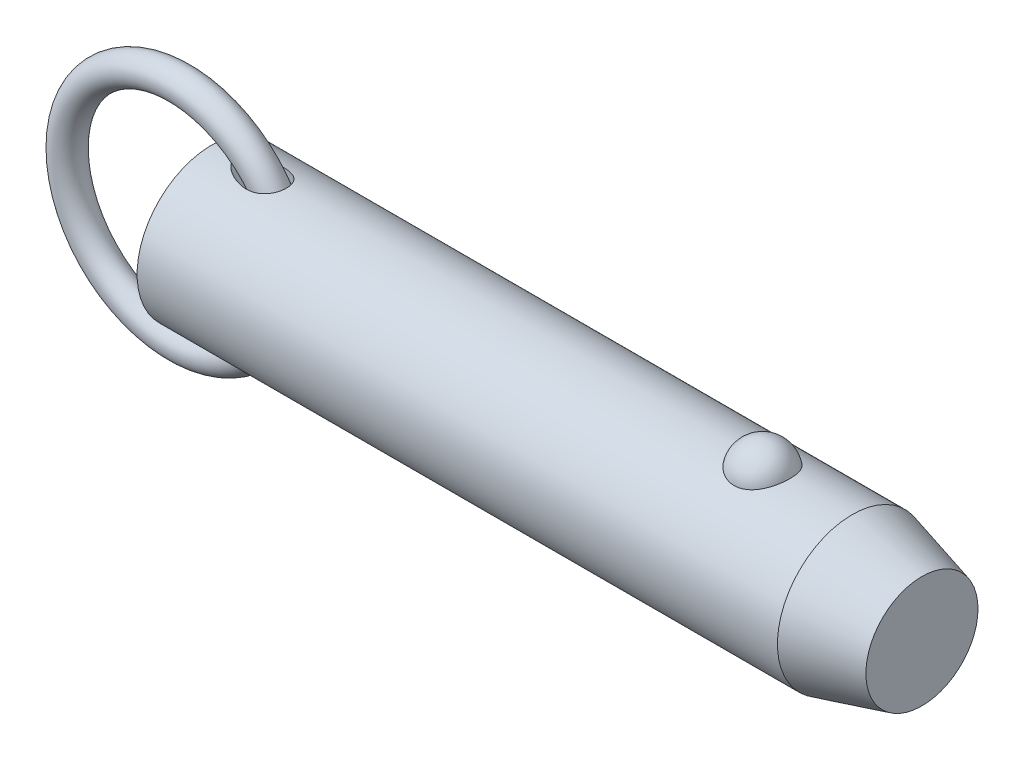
ISO-10303-21;
HEADER;
FILE_DESCRIPTION(('STEP AP214'),'2;1');
FILE_NAME('part.step','',(''),(''),'','','');
FILE_SCHEMA(('AUTOMOTIVE_DESIGN { 1 0 10303 214 1 1 1 1 }'));
ENDSEC;
DATA;
#1=APPLICATION_CONTEXT('core data for automotive mechanical design processes');
#2=APPLICATION_PROTOCOL_DEFINITION('international standard','automotive_design',2000,#1);
#3=PRODUCT_CONTEXT('',#1,'mechanical');
#4=PRODUCT('Part','Part','',(#3));
#5=PRODUCT_RELATED_PRODUCT_CATEGORY('part','',(#4));
#6=PRODUCT_DEFINITION_FORMATION('','',#4);
#7=PRODUCT_DEFINITION_CONTEXT('part definition',#1,'design');
#8=PRODUCT_DEFINITION('design','',#6,#7);
#9=PRODUCT_DEFINITION_SHAPE('','',#8);
#10=(LENGTH_UNIT() NAMED_UNIT(*) SI_UNIT(.MILLI.,.METRE.));
#11=(NAMED_UNIT(*) PLANE_ANGLE_UNIT() SI_UNIT($,.RADIAN.));
#12=(NAMED_UNIT(*) SI_UNIT($,.STERADIAN.) SOLID_ANGLE_UNIT());
#13=UNCERTAINTY_MEASURE_WITH_UNIT(LENGTH_MEASURE(1.E-05),#10,'distance_accuracy_value','');
#14=(GEOMETRIC_REPRESENTATION_CONTEXT(3) GLOBAL_UNCERTAINTY_ASSIGNED_CONTEXT((#13)) GLOBAL_UNIT_ASSIGNED_CONTEXT((#10,
#11,#12)) REPRESENTATION_CONTEXT('',''));
#15=CARTESIAN_POINT('',(0.,0.,0.));
#16=DIRECTION('',(0.,0.,1.));
#17=DIRECTION('',(1.,0.,0.));
#18=AXIS2_PLACEMENT_3D('',#15,#16,#17);
#19=CARTESIAN_POINT('',(-5.53898640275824,0.,0.));
#20=DIRECTION('',(0.,0.,1.));
#21=DIRECTION('',(1.,0.,0.));
#22=AXIS2_PLACEMENT_3D('',#19,#20,#21);
#23=TOROIDAL_SURFACE('',#22,19.05,2.54);
#24=CARTESIAN_POINT('',(16.0510135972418,0.,0.));
#25=VERTEX_POINT('',#24);
#26=VERTEX_LOOP('',#25);
#27=FACE_BOUND('',#26,.T.);
#28=ADVANCED_FACE('P0_F12',(#27),#23,.T.);
#29=CLOSED_SHELL('',(#28));
#30=MANIFOLD_SOLID_BREP('P0_B1',#29);
#31=CARTESIAN_POINT('',(0.,0.,0.));
#32=DIRECTION('',(1.,0.,0.));
#33=DIRECTION('',(0.,0.,-1.));
#34=AXIS2_PLACEMENT_3D('',#31,#32,#33);
#35=CYLINDRICAL_SURFACE('',#34,12.7);
#36=CARTESIAN_POINT('',(108.800738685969,0.,0.));
#37=DIRECTION('',(1.,0.,0.));
#38=DIRECTION('',(0.,0.,-1.));
#39=AXIS2_PLACEMENT_3D('',#36,#37,#38);
#40=CIRCLE('',#39,12.7);
#41=CARTESIAN_POINT('',(108.800738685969,0.,-12.7));
#42=VERTEX_POINT('',#41);
#43=EDGE_CURVE('P1_E89',#42,#42,#40,.T.);
#44=ORIENTED_EDGE('',*,*,#43,.F.);
#45=EDGE_LOOP('',(#44));
#46=FACE_BOUND('',#45,.T.);
#47=CARTESIAN_POINT('',(0.,0.,0.));
#48=DIRECTION('',(1.,0.,0.));
#49=DIRECTION('',(0.,0.,-1.));
#50=AXIS2_PLACEMENT_3D('',#47,#48,#49);
#51=CIRCLE('',#50,12.7);
#52=CARTESIAN_POINT('',(0.,0.,-12.7));
#53=VERTEX_POINT('',#52);
#54=EDGE_CURVE('P1_E52',#53,#53,#51,.T.);
#55=ORIENTED_EDGE('',*,*,#54,.T.);
#56=EDGE_LOOP('',(#55));
#57=FACE_BOUND('',#56,.T.);
#58=CARTESIAN_POINT('',(93.5600429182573,11.7500437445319,4.81938502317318));
#59=CARTESIAN_POINT('',(93.4350881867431,11.7500430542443,4.81938571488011));
#60=CARTESIAN_POINT('',(93.310144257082,11.7520975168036,4.81438658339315));
#61=CARTESIAN_POINT('',(93.0611425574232,11.760253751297,4.79442904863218));
#62=CARTESIAN_POINT('',(92.9370850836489,11.7663568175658,4.77946746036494));
#63=CARTESIAN_POINT('',(92.6909016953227,11.7824262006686,4.7397141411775));
#64=CARTESIAN_POINT('',(92.5687744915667,11.7923898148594,4.71492928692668));
#65=CARTESIAN_POINT('',(92.3271874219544,11.8158938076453,4.65571340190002));
#66=CARTESIAN_POINT('',(92.2077285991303,11.8294355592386,4.6212786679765));
#67=CARTESIAN_POINT('',(91.9725578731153,11.8596812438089,4.54309502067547));
#68=CARTESIAN_POINT('',(91.8568393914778,11.8763792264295,4.49936361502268));
#69=CARTESIAN_POINT('',(91.6296530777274,11.9124878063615,4.40287235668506));
#70=CARTESIAN_POINT('',(91.5181868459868,11.9318994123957,4.35010914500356));
#71=CARTESIAN_POINT('',(91.1912782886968,11.9934256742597,4.17881316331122));
#72=CARTESIAN_POINT('',(90.9831270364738,12.038858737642,4.04720756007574));
#73=CARTESIAN_POINT('',(90.5858509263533,12.1352173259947,3.748564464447));
#74=CARTESIAN_POINT('',(90.3974438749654,12.1862630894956,3.58061821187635));
#75=CARTESIAN_POINT('',(90.0505213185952,12.2875163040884,3.21600758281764));
#76=CARTESIAN_POINT('',(89.8920113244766,12.3377235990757,3.0193379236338));
#77=CARTESIAN_POINT('',(89.6016887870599,12.434492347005,2.592916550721));
#78=CARTESIAN_POINT('',(89.4713762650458,12.4807925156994,2.36208286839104));
#79=CARTESIAN_POINT('',(89.2494079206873,12.5623454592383,1.88070399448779));
#80=CARTESIAN_POINT('',(89.1577554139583,12.5975972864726,1.63015711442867));
#81=CARTESIAN_POINT('',(89.0140466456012,12.6538414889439,1.1129886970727));
#82=CARTESIAN_POINT('',(88.9624990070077,12.6746503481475,0.846205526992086));
#83=CARTESIAN_POINT('',(88.9019771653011,12.699153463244,0.307085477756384));
#84=CARTESIAN_POINT('',(88.8930018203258,12.7028481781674,0.0347487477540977));
#85=CARTESIAN_POINT('',(88.9177310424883,12.6927785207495,-0.506073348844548));
#86=CARTESIAN_POINT('',(88.9511899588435,12.6791146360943,-0.77457186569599));
#87=CARTESIAN_POINT('',(89.0596877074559,12.635882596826,-1.30170246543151));
#88=CARTESIAN_POINT('',(89.1347272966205,12.606314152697,-1.5603343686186));
#89=CARTESIAN_POINT('',(89.3250000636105,12.5342328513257,-2.06083899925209));
#90=CARTESIAN_POINT('',(89.4402872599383,12.4917026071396,-2.3026886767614));
#91=CARTESIAN_POINT('',(89.7087044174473,12.3981123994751,-2.76259600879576));
#92=CARTESIAN_POINT('',(89.8618374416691,12.3470517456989,-2.98065173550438));
#93=CARTESIAN_POINT('',(90.2035077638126,12.2416045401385,-3.38786328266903));
#94=CARTESIAN_POINT('',(90.3922017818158,12.1872040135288,-3.57688418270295));
#95=CARTESIAN_POINT('',(90.8002392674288,12.0814086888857,-3.91941073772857));
#96=CARTESIAN_POINT('',(91.0195800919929,12.0300136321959,-4.07291945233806));
#97=CARTESIAN_POINT('',(91.4783753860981,11.9373542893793,-4.33691289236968));
#98=CARTESIAN_POINT('',(91.7173044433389,11.8958982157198,-4.44824125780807));
#99=CARTESIAN_POINT('',(92.2124376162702,11.8268116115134,-4.62881985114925));
#100=CARTESIAN_POINT('',(92.4686351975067,11.7991758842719,-4.69808589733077));
#101=CARTESIAN_POINT('',(92.9771640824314,11.7622209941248,-4.78983181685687));
#102=CARTESIAN_POINT('',(93.2290414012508,11.7520502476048,-4.81449025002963));
#103=CARTESIAN_POINT('',(93.7335734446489,11.7485796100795,-4.82295735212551));
#104=CARTESIAN_POINT('',(93.9862280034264,11.7552763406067,-4.80677420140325));
#105=CARTESIAN_POINT('',(94.4768341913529,11.7842584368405,-4.73525430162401));
#106=CARTESIAN_POINT('',(94.7149984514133,11.8060486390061,-4.68116061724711));
#107=CARTESIAN_POINT('',(95.1784894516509,11.8622750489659,-4.53678133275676));
#108=CARTESIAN_POINT('',(95.4038151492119,11.8967122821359,-4.44649279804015));
#109=CARTESIAN_POINT('',(95.8408018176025,11.9754603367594,-4.2298761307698));
#110=CARTESIAN_POINT('',(96.0520579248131,12.0199699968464,-4.10280539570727));
#111=CARTESIAN_POINT('',(96.4506012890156,12.1138028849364,-3.81685409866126));
#112=CARTESIAN_POINT('',(96.6378830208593,12.163127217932,-3.65796622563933));
#113=CARTESIAN_POINT('',(96.9933509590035,12.2642343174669,-3.30364864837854));
#114=CARTESIAN_POINT('',(97.1601119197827,12.3160165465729,-3.10678783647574));
#115=CARTESIAN_POINT('',(97.4595799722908,12.4142566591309,-2.68748409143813));
#116=CARTESIAN_POINT('',(97.5922809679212,12.4607135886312,-2.46503658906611));
#117=CARTESIAN_POINT('',(97.8246912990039,12.5450236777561,-1.9928951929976));
#118=CARTESIAN_POINT('',(97.923215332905,12.5825557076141,-1.7425591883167));
#119=CARTESIAN_POINT('',(98.0792277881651,12.6431720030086,-1.22773734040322));
#120=CARTESIAN_POINT('',(98.1367157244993,12.6662560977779,-0.963251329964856));
#121=CARTESIAN_POINT('',(98.2095441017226,12.6956486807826,-0.427355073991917));
#122=CARTESIAN_POINT('',(98.2248378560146,12.7019385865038,-0.155937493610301));
#123=CARTESIAN_POINT('',(98.2127794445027,12.6970201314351,0.385928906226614));
#124=CARTESIAN_POINT('',(98.1854280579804,12.6858120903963,0.656377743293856));
#125=CARTESIAN_POINT('',(98.1130609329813,12.6568455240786,1.05454017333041));
#126=CARTESIAN_POINT('',(98.0837963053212,12.6451962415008,1.18577850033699));
#127=CARTESIAN_POINT('',(98.0150228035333,12.6181819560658,1.4451380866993));
#128=CARTESIAN_POINT('',(97.9755176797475,12.6028183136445,1.57326046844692));
#129=CARTESIAN_POINT('',(97.8864397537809,12.5687547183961,1.82554978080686));
#130=CARTESIAN_POINT('',(97.8368627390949,12.5500533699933,1.9497150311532));
#131=CARTESIAN_POINT('',(97.7279211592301,12.5098093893,2.1931437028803));
#132=CARTESIAN_POINT('',(97.6685601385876,12.4882677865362,2.31240887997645));
#133=CARTESIAN_POINT('',(97.5399712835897,12.4427679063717,2.54593031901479));
#134=CARTESIAN_POINT('',(97.4706888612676,12.4187964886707,2.66015396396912));
#135=CARTESIAN_POINT('',(97.322903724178,12.3691892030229,2.88202659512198));
#136=CARTESIAN_POINT('',(97.2444044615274,12.3435539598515,2.98967802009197));
#137=CARTESIAN_POINT('',(97.0785502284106,12.2912955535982,3.19774385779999));
#138=CARTESIAN_POINT('',(96.9911918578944,12.2646720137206,3.29815546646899));
#139=CARTESIAN_POINT('',(96.8081617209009,12.2111945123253,3.49095035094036));
#140=CARTESIAN_POINT('',(96.7124932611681,12.1843406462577,3.58333679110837));
#141=CARTESIAN_POINT('',(96.5136272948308,12.1312249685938,3.75922876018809));
#142=CARTESIAN_POINT('',(96.4104503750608,12.104961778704,3.84275713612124));
#143=CARTESIAN_POINT('',(96.1970133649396,12.0537284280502,4.00056406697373));
#144=CARTESIAN_POINT('',(96.0867562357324,12.028757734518,4.07484645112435));
#145=CARTESIAN_POINT('',(95.8597550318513,11.9808306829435,4.21367959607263));
#146=CARTESIAN_POINT('',(95.7430068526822,11.9578756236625,4.27822410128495));
#147=CARTESIAN_POINT('',(95.5039425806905,11.9147184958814,4.39698483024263));
#148=CARTESIAN_POINT('',(95.3816287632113,11.894515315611,4.45120522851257));
#149=CARTESIAN_POINT('',(95.122952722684,11.8561129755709,4.55255353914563));
#150=CARTESIAN_POINT('',(94.9862237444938,11.8381764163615,4.59884858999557));
#151=CARTESIAN_POINT('',(94.7086087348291,11.8069093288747,4.67853897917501));
#152=CARTESIAN_POINT('',(94.5677245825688,11.7935767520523,4.71194005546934));
#153=CARTESIAN_POINT('',(94.2830944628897,11.7720277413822,4.76552188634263));
#154=CARTESIAN_POINT('',(94.1393488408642,11.7638106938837,4.78570422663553));
#155=CARTESIAN_POINT('',(93.8504114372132,11.7528195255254,4.81263433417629));
#156=CARTESIAN_POINT('',(93.7052198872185,11.7500445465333,4.81938421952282));
#157=CARTESIAN_POINT('',(93.5600429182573,11.7500437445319,4.81938502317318));
#158=B_SPLINE_CURVE_WITH_KNOTS('',3,(#58,#59,#60,#61,#62,#63,#64,#65,#66,#67,#68,#69,#70,#71,
#72,#73,#74,#75,#76,#77,#78,#79,#80,#81,#82,#83,#84,#85,#86,#87,#88,#89,#90,#91,#92,#93,#94,#95,
#96,#97,#98,#99,#100,#101,#102,#103,#104,#105,#106,#107,#108,#109,#110,#111,#112,#113,#114,#115,
#116,#117,#118,#119,#120,#121,#122,#123,#124,#125,#126,#127,#128,#129,#130,#131,#132,#133,#134,
#135,#136,#137,#138,#139,#140,#141,#142,#143,#144,#145,#146,#147,#148,#149,#150,#151,#152,#153,
#154,#155,#156,#157),.UNSPECIFIED.,.T.,.F.,(4,2,2,2,2,2,2,2,2,2,2,2,2,2,2,2,2,2,2,2,2,2,2,2,2,2,
2,2,2,2,2,2,2,2,2,2,2,2,2,2,2,2,2,2,2,2,2,2,2,4),(0.,0.374729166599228,0.749578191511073,
1.12416526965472,1.49889629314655,1.87292776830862,2.24709865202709,2.99481328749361,
3.76399449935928,4.53331735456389,5.3368391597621,6.14042986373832,6.95405296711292,
7.76765424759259,8.57656703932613,9.38549455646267,10.1955119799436,11.0055949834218,
11.8193353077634,12.6330054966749,13.4294141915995,14.2255231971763,14.9815786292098,
15.7374826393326,16.4696948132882,17.2019663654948,17.9501979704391,18.6986017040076,
19.484470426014,20.2704797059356,21.0815215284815,21.8925729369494,22.7045213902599,
23.5164550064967,23.9209608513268,24.3253187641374,24.7298461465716,25.1342272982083,
25.54092555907,25.9474719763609,26.3541750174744,26.7607169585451,27.1661834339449,
27.5714814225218,27.9770386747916,28.3824315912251,28.8181206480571,29.2536155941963,
29.6890582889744,30.1244323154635),.UNSPECIFIED.);
#159=CARTESIAN_POINT('',(93.5600429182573,11.7500437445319,4.81938502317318));
#160=VERTEX_POINT('',#159);
#161=EDGE_CURVE('P1_E80',#160,#160,#158,.T.);
#162=ORIENTED_EDGE('',*,*,#161,.T.);
#163=EDGE_LOOP('',(#162));
#164=FACE_BOUND('',#163,.T.);
#165=CARTESIAN_POINT('',(-5.53898640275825,0.,0.));
#166=DIRECTION('',(0.796400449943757,-0.604769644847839,0.));
#167=DIRECTION('',(0.604769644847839,0.796400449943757,0.));
#168=AXIS2_PLACEMENT_3D('',#165,#166,#167);
#169=ELLIPSE('',#168,15.9467514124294,12.7);
#170=CARTESIAN_POINT('',(4.09482149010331,12.6864319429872,0.5868939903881));
#171=VERTEX_POINT('',#170);
#172=CARTESIAN_POINT('',(4.09482149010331,12.6864319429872,-0.5868939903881));
#173=VERTEX_POINT('',#172);
#174=EDGE_CURVE('P1_E47',#171,#173,#169,.F.);
#175=ORIENTED_EDGE('',*,*,#174,.T.);
#176=CARTESIAN_POINT('',(4.06153170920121,12.6905758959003,-0.489166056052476));
#177=CARTESIAN_POINT('',(4.08111374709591,12.6881366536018,-0.552489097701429));
#178=CARTESIAN_POINT('',(4.10417851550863,12.6852663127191,-0.614604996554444));
#179=CARTESIAN_POINT('',(4.15628434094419,12.6787965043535,-0.736067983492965));
#180=CARTESIAN_POINT('',(4.18531032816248,12.6751988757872,-0.795421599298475));
#181=CARTESIAN_POINT('',(4.27911159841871,12.6636052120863,-0.967590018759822));
#182=CARTESIAN_POINT('',(4.35123408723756,12.654730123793,-1.07635920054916));
#183=CARTESIAN_POINT('',(4.49106800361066,12.6376715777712,-1.25922957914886));
#184=CARTESIAN_POINT('',(4.55601066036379,12.6297947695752,-1.33556751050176));
#185=CARTESIAN_POINT('',(4.69223626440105,12.6134116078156,-1.48232741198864));
#186=CARTESIAN_POINT('',(4.76352147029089,12.6049050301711,-1.55274725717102));
#187=CARTESIAN_POINT('',(4.91163946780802,12.587417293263,-1.68868704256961));
#188=CARTESIAN_POINT('',(4.98851399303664,12.5784327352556,-1.75416062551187));
#189=CARTESIAN_POINT('',(5.14630057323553,12.560235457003,-1.88003275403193));
#190=CARTESIAN_POINT('',(5.22721398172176,12.5510226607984,-1.94042957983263));
#191=CARTESIAN_POINT('',(5.45368877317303,12.5256514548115,-2.09966332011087));
#192=CARTESIAN_POINT('',(5.60261616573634,12.5094182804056,-2.19371988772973));
#193=CARTESIAN_POINT('',(5.90795545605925,12.4774211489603,-2.36893890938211));
#194=CARTESIAN_POINT('',(6.064372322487,12.4616575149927,-2.45009264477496));
#195=CARTESIAN_POINT('',(6.3830613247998,12.431227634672,-2.60008249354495));
#196=CARTESIAN_POINT('',(6.54533237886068,12.4165611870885,-2.66892086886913));
#197=CARTESIAN_POINT('',(6.87462618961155,12.3889351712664,-2.79435199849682));
#198=CARTESIAN_POINT('',(7.04164773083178,12.3759751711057,-2.8509478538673));
#199=CARTESIAN_POINT('',(7.38726647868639,12.3518460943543,-2.95377962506));
#200=CARTESIAN_POINT('',(7.56604577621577,12.3407843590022,-2.99943209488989));
#201=CARTESIAN_POINT('',(7.92698692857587,12.3219309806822,-3.07596683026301));
#202=CARTESIAN_POINT('',(8.10914972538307,12.314140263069,-3.10684491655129));
#203=CARTESIAN_POINT('',(8.475114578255,12.3025918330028,-3.152268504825));
#204=CARTESIAN_POINT('',(8.65890979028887,12.2988216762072,-3.16686440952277));
#205=CARTESIAN_POINT('',(9.0269608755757,12.2959421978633,-3.17802250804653));
#206=CARTESIAN_POINT('',(9.21121628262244,12.2968292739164,-3.17459864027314));
#207=CARTESIAN_POINT('',(9.61636263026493,12.3045198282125,-3.14471110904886));
#208=CARTESIAN_POINT('',(9.83695552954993,12.3125080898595,-3.1136323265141));
#209=CARTESIAN_POINT('',(10.1619126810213,12.3303028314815,-3.04206574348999));
#210=CARTESIAN_POINT('',(10.2692747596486,12.3372061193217,-3.01403983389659));
#211=CARTESIAN_POINT('',(10.4811758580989,12.3528538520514,-2.94925947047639));
#212=CARTESIAN_POINT('',(10.5857162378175,12.361597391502,-2.91250930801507));
#213=CARTESIAN_POINT('',(10.7921321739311,12.3808585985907,-2.82951748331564));
#214=CARTESIAN_POINT('',(10.8939665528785,12.3913944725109,-2.78317723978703));
#215=CARTESIAN_POINT('',(11.0926118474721,12.4138762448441,-2.68112002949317));
#216=CARTESIAN_POINT('',(11.1894254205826,12.4258213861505,-2.6254080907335));
#217=CARTESIAN_POINT('',(11.3768740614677,12.4507225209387,-2.5046565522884));
#218=CARTESIAN_POINT('',(11.46751150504,12.4636781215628,-2.43962056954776));
#219=CARTESIAN_POINT('',(11.6414572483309,12.4901070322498,-2.30048560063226));
#220=CARTESIAN_POINT('',(11.7247669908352,12.5035802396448,-2.22638840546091));
#221=CARTESIAN_POINT('',(11.8713131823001,12.5285000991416,-2.08117367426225));
#222=CARTESIAN_POINT('',(11.9357009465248,12.5399538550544,-2.01121596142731));
#223=CARTESIAN_POINT('',(12.0576805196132,12.5624496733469,-1.86555293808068));
#224=CARTESIAN_POINT('',(12.1152732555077,12.5734917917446,-1.78984841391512));
#225=CARTESIAN_POINT('',(12.223073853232,12.5947858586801,-1.63327883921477));
#226=CARTESIAN_POINT('',(12.2732844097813,12.6050380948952,-1.55241568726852));
#227=CARTESIAN_POINT('',(12.3658430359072,12.6243983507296,-1.3862126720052));
#228=CARTESIAN_POINT('',(12.4081916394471,12.6335064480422,-1.30087311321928));
#229=CARTESIAN_POINT('',(12.5150098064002,12.6569076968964,-1.05702619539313));
#230=CARTESIAN_POINT('',(12.5703399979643,12.6695746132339,-0.894232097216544));
#231=CARTESIAN_POINT('',(12.6526225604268,12.6886816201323,-0.561391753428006));
#232=CARTESIAN_POINT('',(12.6795825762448,12.6951233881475,-0.391347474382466));
#233=CARTESIAN_POINT('',(12.7041016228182,12.7009766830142,-0.0537636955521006));
#234=CARTESIAN_POINT('',(12.7024538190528,12.7005778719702,0.113714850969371));
#235=CARTESIAN_POINT('',(12.6717240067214,12.6932548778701,0.445979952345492));
#236=CARTESIAN_POINT('',(12.6426435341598,12.6863310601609,0.610766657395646));
#237=CARTESIAN_POINT('',(12.5579769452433,12.6667465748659,0.932429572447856));
#238=CARTESIAN_POINT('',(12.5024793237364,12.6541050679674,1.08933027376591));
#239=CARTESIAN_POINT('',(12.3665691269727,12.6244558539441,1.39146752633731));
#240=CARTESIAN_POINT('',(12.2861577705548,12.6074483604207,1.536704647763));
#241=CARTESIAN_POINT('',(12.1018203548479,12.5706804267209,1.81319588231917));
#242=CARTESIAN_POINT('',(11.9976588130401,12.5508932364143,1.94428915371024));
#243=CARTESIAN_POINT('',(11.7695265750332,12.5107540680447,2.18776051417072));
#244=CARTESIAN_POINT('',(11.6455540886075,12.4904020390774,2.30013691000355));
#245=CARTESIAN_POINT('',(11.3759347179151,12.4502278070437,2.50870972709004));
#246=CARTESIAN_POINT('',(11.2295880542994,12.4304654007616,2.60400962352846));
#247=CARTESIAN_POINT('',(10.9239803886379,12.3941696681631,2.7716292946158));
#248=CARTESIAN_POINT('',(10.7647152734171,12.3776373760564,2.84394171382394));
#249=CARTESIAN_POINT('',(10.4192039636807,12.3473062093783,2.9730352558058));
#250=CARTESIAN_POINT('',(10.231933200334,12.3340204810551,3.02717164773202));
#251=CARTESIAN_POINT('',(9.85152982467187,12.3134301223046,3.10986173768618));
#252=CARTESIAN_POINT('',(9.65839336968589,12.3061295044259,3.13839827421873));
#253=CARTESIAN_POINT('',(9.31022514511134,12.2982822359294,3.16897517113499));
#254=CARTESIAN_POINT('',(9.15555718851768,12.2966525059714,3.17526894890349));
#255=CARTESIAN_POINT('',(8.8461894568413,12.2967963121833,3.17471335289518));
#256=CARTESIAN_POINT('',(8.69148970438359,12.2985715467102,3.16785742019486));
#257=CARTESIAN_POINT('',(8.38280471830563,12.3051648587,3.14214692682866));
#258=CARTESIAN_POINT('',(8.22882218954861,12.3099904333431,3.12326280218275));
#259=CARTESIAN_POINT('',(7.92276070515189,12.3222644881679,3.07448013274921));
#260=CARTESIAN_POINT('',(7.77068148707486,12.3297126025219,3.04458312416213));
#261=CARTESIAN_POINT('',(7.46452663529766,12.3470493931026,2.97350781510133));
#262=CARTESIAN_POINT('',(7.31052714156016,12.3570043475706,2.93201910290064));
#263=CARTESIAN_POINT('',(7.00579083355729,12.3787609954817,2.83876185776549));
#264=CARTESIAN_POINT('',(6.85505451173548,12.3905629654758,2.78699178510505));
#265=CARTESIAN_POINT('',(6.55781208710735,12.415528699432,2.67357744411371));
#266=CARTESIAN_POINT('',(6.4112978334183,12.4286895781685,2.61195394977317));
#267=CARTESIAN_POINT('',(6.12302950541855,12.4559398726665,2.47874512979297));
#268=CARTESIAN_POINT('',(5.98127390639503,12.4700289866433,2.40716303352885));
#269=CARTESIAN_POINT('',(5.67073126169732,12.5020754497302,2.23550426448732));
#270=CARTESIAN_POINT('',(5.50343839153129,12.5201625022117,2.13268685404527));
#271=CARTESIAN_POINT('',(5.2614761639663,12.5471537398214,1.96522579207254));
#272=CARTESIAN_POINT('',(5.18224299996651,12.5561365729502,1.90713440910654));
#273=CARTESIAN_POINT('',(5.02746475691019,12.573912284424,1.78618989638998));
#274=CARTESIAN_POINT('',(4.95191912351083,12.5827051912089,1.72333748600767));
#275=CARTESIAN_POINT('',(4.81787163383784,12.598469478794,1.60360864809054));
#276=CARTESIAN_POINT('',(4.75865966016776,12.6054958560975,1.54753994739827));
#277=CARTESIAN_POINT('',(4.64406285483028,12.6191906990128,1.43158546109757));
#278=CARTESIAN_POINT('',(4.58867926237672,12.6258590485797,1.37169845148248));
#279=CARTESIAN_POINT('',(4.43014912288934,12.6450546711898,1.1865667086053));
#280=CARTESIAN_POINT('',(4.33372726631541,12.6568788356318,1.05507993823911));
#281=CARTESIAN_POINT('',(4.21252055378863,12.6718304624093,0.848052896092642));
#282=CARTESIAN_POINT('',(4.17660155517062,12.6762773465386,0.779100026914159));
#283=CARTESIAN_POINT('',(4.11264979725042,12.6842122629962,0.637080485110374));
#284=CARTESIAN_POINT('',(4.08466792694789,12.6876941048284,0.563990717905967));
#285=CARTESIAN_POINT('',(4.06153170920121,12.6905758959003,0.489166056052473));
#286=B_SPLINE_CURVE_WITH_KNOTS('',3,(#176,#177,#178,#179,#180,#181,#182,#183,#184,#185,#186,
#187,#188,#189,#190,#191,#192,#193,#194,#195,#196,#197,#198,#199,#200,#201,#202,#203,#204,#205,
#206,#207,#208,#209,#210,#211,#212,#213,#214,#215,#216,#217,#218,#219,#220,#221,#222,#223,#224,
#225,#226,#227,#228,#229,#230,#231,#232,#233,#234,#235,#236,#237,#238,#239,#240,#241,#242,#243,
#244,#245,#246,#247,#248,#249,#250,#251,#252,#253,#254,#255,#256,#257,#258,#259,#260,#261,#262,
#263,#264,#265,#266,#267,#268,#269,#270,#271,#272,#273,#274,#275,#276,#277,#278,#279,#280,#281,
#282,#283,#284,#285),.UNSPECIFIED.,.F.,.F.,(4,2,2,2,2,2,2,2,2,2,2,2,2,2,2,2,2,2,2,2,2,2,2,2,2,2,
2,2,2,2,2,2,2,2,2,2,2,2,2,2,2,2,2,2,2,2,2,2,2,2,2,2,2,2,4),(0.,0.198708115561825,
0.396919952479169,0.787580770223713,1.08882492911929,1.39017679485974,1.69407136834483,
1.99806847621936,2.52793143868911,3.0581509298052,3.588272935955,4.11826050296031,
4.67218806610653,5.22627222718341,5.77863637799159,6.33057333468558,6.99657211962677,
7.3297741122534,7.662812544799,7.99946156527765,8.33593054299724,8.67226935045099,
9.0085417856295,9.29544181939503,9.58230266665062,9.86905853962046,10.1557949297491,
10.6702338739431,11.1845341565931,11.6845985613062,12.1846349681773,12.6830079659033,
13.1813565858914,13.68487951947,14.1884479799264,14.713533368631,15.2387866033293,
15.8228373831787,16.407279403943,16.8710810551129,17.3351141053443,17.8002921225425,
18.2654052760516,18.7444169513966,19.2235004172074,19.7015868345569,20.1795185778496,
20.7699825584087,21.0658110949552,21.3615950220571,21.606957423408,21.8523988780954,
22.3397467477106,22.5729183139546,22.8075527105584),.UNSPECIFIED.);
#287=EDGE_CURVE('P1_E51',#173,#171,#286,.T.);
#288=ORIENTED_EDGE('',*,*,#287,.T.);
#289=EDGE_LOOP('',(#175,#288));
#290=FACE_BOUND('',#289,.T.);
#291=CARTESIAN_POINT('',(-5.53898640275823,0.,0.));
#292=DIRECTION('',(-0.796400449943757,-0.604769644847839,0.));
#293=DIRECTION('',(0.604769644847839,-0.796400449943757,0.));
#294=AXIS2_PLACEMENT_3D('',#291,#292,#293);
#295=ELLIPSE('',#294,15.9467514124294,12.7);
#296=CARTESIAN_POINT('',(4.09482149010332,-12.6864319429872,0.58689399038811));
#297=VERTEX_POINT('',#296);
#298=CARTESIAN_POINT('',(4.09482149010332,-12.6864319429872,-0.58689399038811));
#299=VERTEX_POINT('',#298);
#300=EDGE_CURVE('P1_E28',#297,#299,#295,.F.);
#301=ORIENTED_EDGE('',*,*,#300,.F.);
#302=CARTESIAN_POINT('',(4.06153170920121,-12.6905758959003,0.489166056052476));
#303=CARTESIAN_POINT('',(4.08111374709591,-12.6881366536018,0.552489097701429));
#304=CARTESIAN_POINT('',(4.10417851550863,-12.6852663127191,0.614604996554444));
#305=CARTESIAN_POINT('',(4.15628434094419,-12.6787965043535,0.736067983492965));
#306=CARTESIAN_POINT('',(4.18531032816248,-12.6751988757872,0.795421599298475));
#307=CARTESIAN_POINT('',(4.27911159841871,-12.6636052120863,0.967590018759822));
#308=CARTESIAN_POINT('',(4.35123408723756,-12.654730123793,1.07635920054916));
#309=CARTESIAN_POINT('',(4.49106800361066,-12.6376715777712,1.25922957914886));
#310=CARTESIAN_POINT('',(4.55601066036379,-12.6297947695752,1.33556751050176));
#311=CARTESIAN_POINT('',(4.69223626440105,-12.6134116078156,1.48232741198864));
#312=CARTESIAN_POINT('',(4.76352147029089,-12.6049050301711,1.55274725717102));
#313=CARTESIAN_POINT('',(4.91163946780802,-12.587417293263,1.68868704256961));
#314=CARTESIAN_POINT('',(4.98851399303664,-12.5784327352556,1.75416062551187));
#315=CARTESIAN_POINT('',(5.14630057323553,-12.560235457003,1.88003275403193));
#316=CARTESIAN_POINT('',(5.22721398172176,-12.5510226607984,1.94042957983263));
#317=CARTESIAN_POINT('',(5.45368877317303,-12.5256514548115,2.09966332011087));
#318=CARTESIAN_POINT('',(5.60261616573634,-12.5094182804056,2.19371988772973));
#319=CARTESIAN_POINT('',(5.90795545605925,-12.4774211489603,2.36893890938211));
#320=CARTESIAN_POINT('',(6.064372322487,-12.4616575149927,2.45009264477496));
#321=CARTESIAN_POINT('',(6.3830613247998,-12.431227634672,2.60008249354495));
#322=CARTESIAN_POINT('',(6.54533237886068,-12.4165611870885,2.66892086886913));
#323=CARTESIAN_POINT('',(6.87462618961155,-12.3889351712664,2.79435199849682));
#324=CARTESIAN_POINT('',(7.04164773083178,-12.3759751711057,2.8509478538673));
#325=CARTESIAN_POINT('',(7.38726647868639,-12.3518460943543,2.95377962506));
#326=CARTESIAN_POINT('',(7.56604577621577,-12.3407843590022,2.99943209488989));
#327=CARTESIAN_POINT('',(7.92698692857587,-12.3219309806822,3.07596683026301));
#328=CARTESIAN_POINT('',(8.10914972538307,-12.314140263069,3.10684491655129));
#329=CARTESIAN_POINT('',(8.475114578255,-12.3025918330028,3.152268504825));
#330=CARTESIAN_POINT('',(8.65890979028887,-12.2988216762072,3.16686440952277));
#331=CARTESIAN_POINT('',(9.0269608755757,-12.2959421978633,3.17802250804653));
#332=CARTESIAN_POINT('',(9.21121628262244,-12.2968292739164,3.17459864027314));
#333=CARTESIAN_POINT('',(9.61636263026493,-12.3045198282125,3.14471110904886));
#334=CARTESIAN_POINT('',(9.83695552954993,-12.3125080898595,3.1136323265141));
#335=CARTESIAN_POINT('',(10.1619126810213,-12.3303028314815,3.04206574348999));
#336=CARTESIAN_POINT('',(10.2692747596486,-12.3372061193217,3.01403983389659));
#337=CARTESIAN_POINT('',(10.4811758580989,-12.3528538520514,2.94925947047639));
#338=CARTESIAN_POINT('',(10.5857162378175,-12.361597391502,2.91250930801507));
#339=CARTESIAN_POINT('',(10.7921321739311,-12.3808585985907,2.82951748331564));
#340=CARTESIAN_POINT('',(10.8939665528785,-12.3913944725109,2.78317723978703));
#341=CARTESIAN_POINT('',(11.0926118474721,-12.4138762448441,2.68112002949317));
#342=CARTESIAN_POINT('',(11.1894254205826,-12.4258213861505,2.6254080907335));
#343=CARTESIAN_POINT('',(11.3768740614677,-12.4507225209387,2.5046565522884));
#344=CARTESIAN_POINT('',(11.46751150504,-12.4636781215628,2.43962056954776));
#345=CARTESIAN_POINT('',(11.6414572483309,-12.4901070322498,2.30048560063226));
#346=CARTESIAN_POINT('',(11.7247669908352,-12.5035802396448,2.22638840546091));
#347=CARTESIAN_POINT('',(11.8713131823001,-12.5285000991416,2.08117367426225));
#348=CARTESIAN_POINT('',(11.9357009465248,-12.5399538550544,2.01121596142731));
#349=CARTESIAN_POINT('',(12.0576805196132,-12.5624496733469,1.86555293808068));
#350=CARTESIAN_POINT('',(12.1152732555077,-12.5734917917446,1.78984841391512));
#351=CARTESIAN_POINT('',(12.223073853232,-12.5947858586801,1.63327883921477));
#352=CARTESIAN_POINT('',(12.2732844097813,-12.6050380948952,1.55241568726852));
#353=CARTESIAN_POINT('',(12.3658430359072,-12.6243983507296,1.3862126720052));
#354=CARTESIAN_POINT('',(12.4081916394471,-12.6335064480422,1.30087311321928));
#355=CARTESIAN_POINT('',(12.5150098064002,-12.6569076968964,1.05702619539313));
#356=CARTESIAN_POINT('',(12.5703399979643,-12.6695746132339,0.894232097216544));
#357=CARTESIAN_POINT('',(12.6526225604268,-12.6886816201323,0.561391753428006));
#358=CARTESIAN_POINT('',(12.6795825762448,-12.6951233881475,0.391347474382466));
#359=CARTESIAN_POINT('',(12.7041016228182,-12.7009766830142,0.0537636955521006));
#360=CARTESIAN_POINT('',(12.7024538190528,-12.7005778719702,-0.113714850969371));
#361=CARTESIAN_POINT('',(12.6717240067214,-12.6932548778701,-0.445979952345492));
#362=CARTESIAN_POINT('',(12.6426435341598,-12.6863310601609,-0.610766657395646));
#363=CARTESIAN_POINT('',(12.5579769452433,-12.6667465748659,-0.932429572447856));
#364=CARTESIAN_POINT('',(12.5024793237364,-12.6541050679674,-1.08933027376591));
#365=CARTESIAN_POINT('',(12.3665691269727,-12.6244558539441,-1.39146752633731));
#366=CARTESIAN_POINT('',(12.2861577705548,-12.6074483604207,-1.536704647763));
#367=CARTESIAN_POINT('',(12.1018203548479,-12.5706804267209,-1.81319588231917));
#368=CARTESIAN_POINT('',(11.9976588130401,-12.5508932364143,-1.94428915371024));
#369=CARTESIAN_POINT('',(11.7695265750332,-12.5107540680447,-2.18776051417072));
#370=CARTESIAN_POINT('',(11.6455540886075,-12.4904020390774,-2.30013691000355));
#371=CARTESIAN_POINT('',(11.3759347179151,-12.4502278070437,-2.50870972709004));
#372=CARTESIAN_POINT('',(11.2295880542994,-12.4304654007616,-2.60400962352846));
#373=CARTESIAN_POINT('',(10.9239803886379,-12.3941696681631,-2.7716292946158));
#374=CARTESIAN_POINT('',(10.7647152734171,-12.3776373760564,-2.84394171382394));
#375=CARTESIAN_POINT('',(10.4192039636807,-12.3473062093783,-2.9730352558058));
#376=CARTESIAN_POINT('',(10.231933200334,-12.3340204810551,-3.02717164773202));
#377=CARTESIAN_POINT('',(9.85152982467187,-12.3134301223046,-3.10986173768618));
#378=CARTESIAN_POINT('',(9.65839336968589,-12.3061295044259,-3.13839827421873));
#379=CARTESIAN_POINT('',(9.31022514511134,-12.2982822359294,-3.16897517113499));
#380=CARTESIAN_POINT('',(9.15555718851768,-12.2966525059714,-3.17526894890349));
#381=CARTESIAN_POINT('',(8.8461894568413,-12.2967963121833,-3.17471335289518));
#382=CARTESIAN_POINT('',(8.69148970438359,-12.2985715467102,-3.16785742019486));
#383=CARTESIAN_POINT('',(8.38280471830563,-12.3051648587,-3.14214692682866));
#384=CARTESIAN_POINT('',(8.22882218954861,-12.3099904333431,-3.12326280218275));
#385=CARTESIAN_POINT('',(7.92276070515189,-12.3222644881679,-3.07448013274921));
#386=CARTESIAN_POINT('',(7.77068148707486,-12.3297126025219,-3.04458312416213));
#387=CARTESIAN_POINT('',(7.46452663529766,-12.3470493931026,-2.97350781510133));
#388=CARTESIAN_POINT('',(7.31052714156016,-12.3570043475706,-2.93201910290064));
#389=CARTESIAN_POINT('',(7.00579083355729,-12.3787609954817,-2.83876185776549));
#390=CARTESIAN_POINT('',(6.85505451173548,-12.3905629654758,-2.78699178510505));
#391=CARTESIAN_POINT('',(6.55781208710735,-12.415528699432,-2.67357744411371));
#392=CARTESIAN_POINT('',(6.4112978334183,-12.4286895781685,-2.61195394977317));
#393=CARTESIAN_POINT('',(6.12302950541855,-12.4559398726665,-2.47874512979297));
#394=CARTESIAN_POINT('',(5.98127390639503,-12.4700289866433,-2.40716303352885));
#395=CARTESIAN_POINT('',(5.67073126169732,-12.5020754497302,-2.23550426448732));
#396=CARTESIAN_POINT('',(5.50343839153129,-12.5201625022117,-2.13268685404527));
#397=CARTESIAN_POINT('',(5.2614761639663,-12.5471537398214,-1.96522579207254));
#398=CARTESIAN_POINT('',(5.18224299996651,-12.5561365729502,-1.90713440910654));
#399=CARTESIAN_POINT('',(5.02746475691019,-12.573912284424,-1.78618989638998));
#400=CARTESIAN_POINT('',(4.95191912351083,-12.5827051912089,-1.72333748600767));
#401=CARTESIAN_POINT('',(4.81787163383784,-12.598469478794,-1.60360864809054));
#402=CARTESIAN_POINT('',(4.75865966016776,-12.6054958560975,-1.54753994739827));
#403=CARTESIAN_POINT('',(4.64406285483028,-12.6191906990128,-1.43158546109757));
#404=CARTESIAN_POINT('',(4.58867926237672,-12.6258590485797,-1.37169845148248));
#405=CARTESIAN_POINT('',(4.43014912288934,-12.6450546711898,-1.1865667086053));
#406=CARTESIAN_POINT('',(4.33372726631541,-12.6568788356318,-1.05507993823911));
#407=CARTESIAN_POINT('',(4.21252055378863,-12.6718304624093,-0.848052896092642));
#408=CARTESIAN_POINT('',(4.17660155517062,-12.6762773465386,-0.779100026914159));
#409=CARTESIAN_POINT('',(4.11264979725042,-12.6842122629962,-0.637080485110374));
#410=CARTESIAN_POINT('',(4.08466792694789,-12.6876941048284,-0.563990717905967));
#411=CARTESIAN_POINT('',(4.06153170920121,-12.6905758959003,-0.489166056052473));
#412=B_SPLINE_CURVE_WITH_KNOTS('',3,(#302,#303,#304,#305,#306,#307,#308,#309,#310,#311,#312,
#313,#314,#315,#316,#317,#318,#319,#320,#321,#322,#323,#324,#325,#326,#327,#328,#329,#330,#331,
#332,#333,#334,#335,#336,#337,#338,#339,#340,#341,#342,#343,#344,#345,#346,#347,#348,#349,#350,
#351,#352,#353,#354,#355,#356,#357,#358,#359,#360,#361,#362,#363,#364,#365,#366,#367,#368,#369,
#370,#371,#372,#373,#374,#375,#376,#377,#378,#379,#380,#381,#382,#383,#384,#385,#386,#387,#388,
#389,#390,#391,#392,#393,#394,#395,#396,#397,#398,#399,#400,#401,#402,#403,#404,#405,#406,#407,
#408,#409,#410,#411),.UNSPECIFIED.,.F.,.F.,(4,2,2,2,2,2,2,2,2,2,2,2,2,2,2,2,2,2,2,2,2,2,2,2,2,2,
2,2,2,2,2,2,2,2,2,2,2,2,2,2,2,2,2,2,2,2,2,2,2,2,2,2,2,2,4),(0.,0.198708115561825,
0.396919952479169,0.787580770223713,1.08882492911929,1.39017679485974,1.69407136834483,
1.99806847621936,2.52793143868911,3.0581509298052,3.588272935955,4.11826050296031,
4.67218806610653,5.22627222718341,5.77863637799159,6.33057333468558,6.99657211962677,
7.3297741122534,7.662812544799,7.99946156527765,8.33593054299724,8.67226935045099,
9.0085417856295,9.29544181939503,9.58230266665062,9.86905853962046,10.1557949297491,
10.6702338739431,11.1845341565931,11.6845985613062,12.1846349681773,12.6830079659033,
13.1813565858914,13.68487951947,14.1884479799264,14.713533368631,15.2387866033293,
15.8228373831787,16.407279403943,16.8710810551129,17.3351141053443,17.8002921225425,
18.2654052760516,18.7444169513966,19.2235004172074,19.7015868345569,20.1795185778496,
20.7699825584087,21.0658110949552,21.3615950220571,21.606957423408,21.8523988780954,
22.3397467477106,22.5729183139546,22.8075527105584),.UNSPECIFIED.);
#413=EDGE_CURVE('P1_E10',#297,#299,#412,.T.);
#414=ORIENTED_EDGE('',*,*,#413,.T.);
#415=EDGE_LOOP('',(#301,#414));
#416=FACE_BOUND('',#415,.T.);
#417=ADVANCED_FACE('P1_F15',(#46,#57,#164,#290,#416),#35,.T.);
#418=CARTESIAN_POINT('',(0.,0.,0.));
#419=DIRECTION('',(-1.,0.,0.));
#420=DIRECTION('',(0.,0.,1.));
#421=AXIS2_PLACEMENT_3D('',#418,#419,#420);
#422=PLANE('',#421);
#423=ORIENTED_EDGE('',*,*,#54,.F.);
#424=EDGE_LOOP('',(#423));
#425=FACE_BOUND('',#424,.T.);
#426=ADVANCED_FACE('P1_F17',(#425),#422,.T.);
#427=CARTESIAN_POINT('',(120.65,0.,0.));
#428=DIRECTION('',(-1.,0.,0.));
#429=DIRECTION('',(0.,0.,1.));
#430=AXIS2_PLACEMENT_3D('',#427,#428,#429);
#431=CONICAL_SURFACE('',#430,9.52500000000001,0.26179938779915);
#432=ORIENTED_EDGE('',*,*,#43,.T.);
#433=EDGE_LOOP('',(#432));
#434=FACE_BOUND('',#433,.T.);
#435=CARTESIAN_POINT('',(120.65,0.,0.));
#436=DIRECTION('',(1.,0.,0.));
#437=DIRECTION('',(0.,0.,-1.));
#438=AXIS2_PLACEMENT_3D('',#435,#436,#437);
#439=CIRCLE('',#438,9.52500000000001);
#440=CARTESIAN_POINT('',(120.65,0.,-9.52500000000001));
#441=VERTEX_POINT('',#440);
#442=EDGE_CURVE('P1_E86',#441,#441,#439,.T.);
#443=ORIENTED_EDGE('',*,*,#442,.F.);
#444=EDGE_LOOP('',(#443));
#445=FACE_BOUND('',#444,.T.);
#446=ADVANCED_FACE('P1_F105',(#434,#445),#431,.T.);
#447=CARTESIAN_POINT('',(120.65,9.52500000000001,0.));
#448=DIRECTION('',(1.,0.,0.));
#449=DIRECTION('',(0.,0.,-1.));
#450=AXIS2_PLACEMENT_3D('',#447,#448,#449);
#451=PLANE('',#450);
#452=ORIENTED_EDGE('',*,*,#442,.T.);
#453=EDGE_LOOP('',(#452));
#454=FACE_BOUND('',#453,.T.);
#455=ADVANCED_FACE('P1_F78',(#454),#451,.T.);
#456=CARTESIAN_POINT('',(93.5600429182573,11.43,0.));
#457=DIRECTION('',(-1.,0.,0.));
#458=DIRECTION('',(0.,-1.,0.));
#459=AXIS2_PLACEMENT_3D('',#456,#457,#458);
#460=SPHERICAL_SURFACE('',#459,4.83);
#461=ORIENTED_EDGE('',*,*,#161,.F.);
#462=EDGE_LOOP('',(#461));
#463=FACE_BOUND('',#462,.T.);
#464=ADVANCED_FACE('P1_F71',(#463),#460,.T.);
#465=CARTESIAN_POINT('',(-5.53898640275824,0.,0.));
#466=DIRECTION('',(0.,0.,1.));
#467=DIRECTION('',(1.,0.,0.));
#468=AXIS2_PLACEMENT_3D('',#465,#466,#467);
#469=TOROIDAL_SURFACE('',#468,19.05,3.175);
#470=CARTESIAN_POINT('',(5.9818753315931,-15.1714285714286,0.));
#471=DIRECTION('',(-0.796400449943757,-0.604769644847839,0.));
#472=DIRECTION('',(0.604769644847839,-0.796400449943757,0.));
#473=AXIS2_PLACEMENT_3D('',#470,#471,#472);
#474=CIRCLE('',#473,3.175);
#475=EDGE_CURVE('P1_E34',#297,#299,#474,.T.);
#476=ORIENTED_EDGE('',*,*,#475,.T.);
#477=ORIENTED_EDGE('',*,*,#413,.F.);
#478=EDGE_LOOP('',(#476,#477));
#479=FACE_BOUND('',#478,.T.);
#480=CARTESIAN_POINT('',(5.9818753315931,15.1714285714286,0.));
#481=DIRECTION('',(0.796400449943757,-0.604769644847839,0.));
#482=DIRECTION('',(0.604769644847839,0.796400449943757,0.));
#483=AXIS2_PLACEMENT_3D('',#480,#481,#482);
#484=CIRCLE('',#483,3.175);
#485=EDGE_CURVE('P1_E41',#171,#173,#484,.T.);
#486=ORIENTED_EDGE('',*,*,#485,.F.);
#487=ORIENTED_EDGE('',*,*,#287,.F.);
#488=EDGE_LOOP('',(#486,#487));
#489=FACE_BOUND('',#488,.T.);
#490=ADVANCED_FACE('P1_F55',(#479,#489),#469,.F.);
#491=CARTESIAN_POINT('',(5.9818753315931,-15.1714285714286,0.));
#492=DIRECTION('',(-0.796400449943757,-0.604769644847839,0.));
#493=DIRECTION('',(0.604769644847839,-0.796400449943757,0.));
#494=AXIS2_PLACEMENT_3D('',#491,#492,#493);
#495=PLANE('',#494);
#496=ORIENTED_EDGE('',*,*,#300,.T.);
#497=ORIENTED_EDGE('',*,*,#475,.F.);
#498=EDGE_LOOP('',(#496,#497));
#499=FACE_BOUND('',#498,.T.);
#500=ADVANCED_FACE('P1_F70',(#499),#495,.F.);
#501=CARTESIAN_POINT('',(5.9818753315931,15.1714285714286,0.));
#502=DIRECTION('',(0.796400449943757,-0.604769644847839,0.));
#503=DIRECTION('',(0.604769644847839,0.796400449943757,0.));
#504=AXIS2_PLACEMENT_3D('',#501,#502,#503);
#505=PLANE('',#504);
#506=ORIENTED_EDGE('',*,*,#485,.T.);
#507=ORIENTED_EDGE('',*,*,#174,.F.);
#508=EDGE_LOOP('',(#506,#507));
#509=FACE_BOUND('',#508,.T.);
#510=ADVANCED_FACE('P1_F48',(#509),#505,.T.);
#511=CLOSED_SHELL('',(#417,#426,#446,#455,#464,#490,#500,#510));
#512=MANIFOLD_SOLID_BREP('P1_B1',#511);
#513=ADVANCED_BREP_SHAPE_REPRESENTATION('',(#18,#30,#512),#14);
#514=SHAPE_DEFINITION_REPRESENTATION(#9,#513);
ENDSEC;
END-ISO-10303-21;
